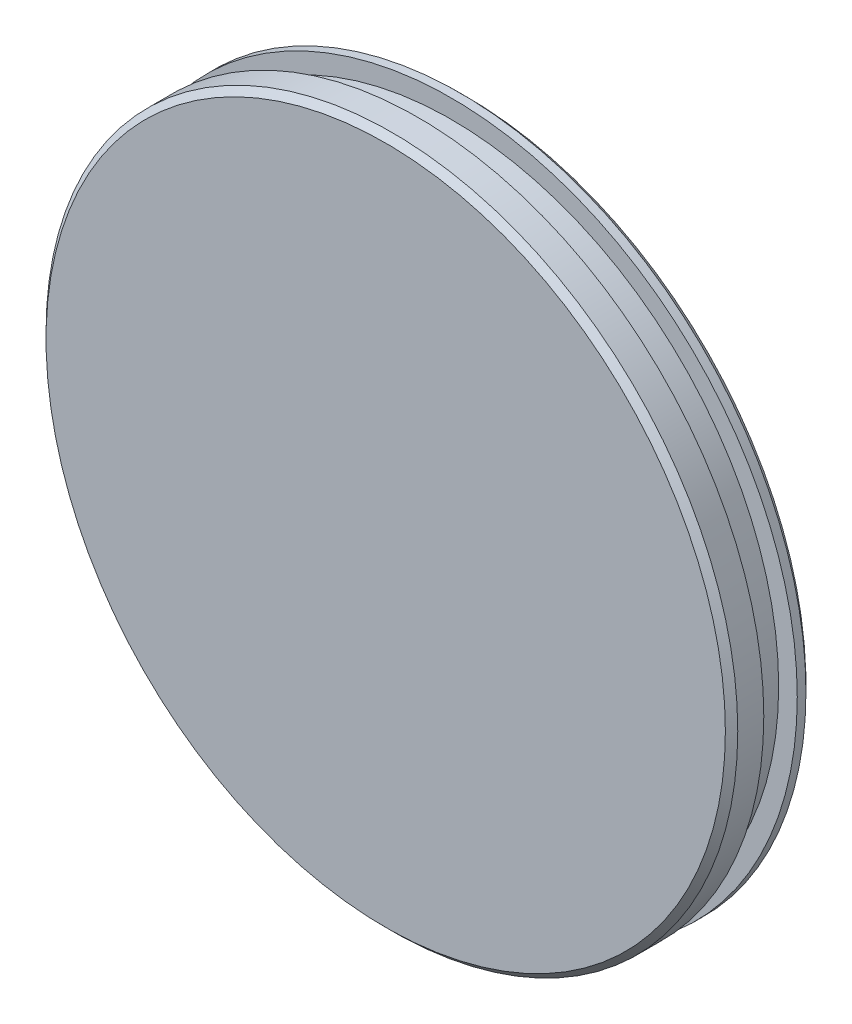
ISO-10303-21;
HEADER;
FILE_DESCRIPTION(('STEP AP214'),'2;1');
FILE_NAME('part.step','',(''),(''),'','','');
FILE_SCHEMA(('AUTOMOTIVE_DESIGN { 1 0 10303 214 1 1 1 1 }'));
ENDSEC;
DATA;
#1=APPLICATION_CONTEXT('core data for automotive mechanical design processes');
#2=APPLICATION_PROTOCOL_DEFINITION('international standard','automotive_design',2000,#1);
#3=PRODUCT_CONTEXT('',#1,'mechanical');
#4=PRODUCT('Part','Part','',(#3));
#5=PRODUCT_RELATED_PRODUCT_CATEGORY('part','',(#4));
#6=PRODUCT_DEFINITION_FORMATION('','',#4);
#7=PRODUCT_DEFINITION_CONTEXT('part definition',#1,'design');
#8=PRODUCT_DEFINITION('design','',#6,#7);
#9=PRODUCT_DEFINITION_SHAPE('','',#8);
#10=(LENGTH_UNIT() NAMED_UNIT(*) SI_UNIT(.MILLI.,.METRE.));
#11=(NAMED_UNIT(*) PLANE_ANGLE_UNIT() SI_UNIT($,.RADIAN.));
#12=(NAMED_UNIT(*) SI_UNIT($,.STERADIAN.) SOLID_ANGLE_UNIT());
#13=UNCERTAINTY_MEASURE_WITH_UNIT(LENGTH_MEASURE(1.E-05),#10,'distance_accuracy_value','');
#14=(GEOMETRIC_REPRESENTATION_CONTEXT(3) GLOBAL_UNCERTAINTY_ASSIGNED_CONTEXT((#13)) GLOBAL_UNIT_ASSIGNED_CONTEXT((#10,
#11,#12)) REPRESENTATION_CONTEXT('',''));
#15=CARTESIAN_POINT('',(0.,0.,0.));
#16=DIRECTION('',(0.,0.,1.));
#17=DIRECTION('',(1.,0.,0.));
#18=AXIS2_PLACEMENT_3D('',#15,#16,#17);
#19=CARTESIAN_POINT('',(27.9,0.,0.));
#20=DIRECTION('',(0.,0.,1.));
#21=DIRECTION('',(1.,0.,0.));
#22=AXIS2_PLACEMENT_3D('',#19,#20,#21);
#23=PLANE('',#22);
#24=CARTESIAN_POINT('',(27.9,0.,0.));
#25=DIRECTION('',(0.,0.,1.));
#26=DIRECTION('',(1.,0.,0.));
#27=AXIS2_PLACEMENT_3D('',#24,#25,#26);
#28=CIRCLE('',#27,27.4);
#29=CARTESIAN_POINT('',(55.3,0.,0.));
#30=VERTEX_POINT('',#29);
#31=EDGE_CURVE('E37',#30,#30,#28,.T.);
#32=ORIENTED_EDGE('',*,*,#31,.T.);
#33=EDGE_LOOP('',(#32));
#34=FACE_BOUND('',#33,.T.);
#35=ADVANCED_FACE('F14',(#34),#23,.T.);
#36=CARTESIAN_POINT('',(27.9,0.,0.));
#37=DIRECTION('',(0.,0.,1.));
#38=DIRECTION('',(1.,0.,0.));
#39=AXIS2_PLACEMENT_3D('',#36,#37,#38);
#40=CYLINDRICAL_SURFACE('',#39,27.9);
#41=CARTESIAN_POINT('',(27.9,0.,-0.499999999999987));
#42=DIRECTION('',(0.,0.,1.));
#43=DIRECTION('',(1.,0.,0.));
#44=AXIS2_PLACEMENT_3D('',#41,#42,#43);
#45=CIRCLE('',#44,27.9);
#46=CARTESIAN_POINT('',(55.8,0.,-0.499999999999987));
#47=VERTEX_POINT('',#46);
#48=EDGE_CURVE('E34',#47,#47,#45,.F.);
#49=ORIENTED_EDGE('',*,*,#48,.T.);
#50=EDGE_LOOP('',(#49));
#51=FACE_BOUND('',#50,.T.);
#52=CARTESIAN_POINT('',(27.9,0.,-2.6));
#53=DIRECTION('',(0.,0.,1.));
#54=DIRECTION('',(1.,0.,0.));
#55=AXIS2_PLACEMENT_3D('',#52,#53,#54);
#56=CIRCLE('',#55,27.9);
#57=CARTESIAN_POINT('',(55.8,0.,-2.6));
#58=VERTEX_POINT('',#57);
#59=EDGE_CURVE('E46',#58,#58,#56,.T.);
#60=ORIENTED_EDGE('',*,*,#59,.T.);
#61=EDGE_LOOP('',(#60));
#62=FACE_BOUND('',#61,.T.);
#63=ADVANCED_FACE('F84',(#51,#62),#40,.T.);
#64=CARTESIAN_POINT('',(0.,0.,-2.6));
#65=DIRECTION('',(0.,0.,-1.));
#66=DIRECTION('',(-1.,0.,0.));
#67=AXIS2_PLACEMENT_3D('',#64,#65,#66);
#68=PLANE('',#67);
#69=CARTESIAN_POINT('',(27.9,0.,-2.6));
#70=DIRECTION('',(0.,0.,1.));
#71=DIRECTION('',(1.,0.,0.));
#72=AXIS2_PLACEMENT_3D('',#69,#70,#71);
#73=CIRCLE('',#72,26.4);
#74=CARTESIAN_POINT('',(54.3,0.,-2.6));
#75=VERTEX_POINT('',#74);
#76=EDGE_CURVE('E49',#75,#75,#73,.T.);
#77=ORIENTED_EDGE('',*,*,#76,.T.);
#78=EDGE_LOOP('',(#77));
#79=FACE_BOUND('',#78,.T.);
#80=ORIENTED_EDGE('',*,*,#59,.F.);
#81=EDGE_LOOP('',(#80));
#82=FACE_BOUND('',#81,.T.);
#83=ADVANCED_FACE('F91',(#79,#82),#68,.T.);
#84=CARTESIAN_POINT('',(27.9,0.,0.));
#85=DIRECTION('',(0.,0.,1.));
#86=DIRECTION('',(1.,0.,0.));
#87=AXIS2_PLACEMENT_3D('',#84,#85,#86);
#88=CYLINDRICAL_SURFACE('',#87,26.4);
#89=CARTESIAN_POINT('',(27.9,0.,-5.3));
#90=DIRECTION('',(0.,0.,1.));
#91=DIRECTION('',(1.,0.,0.));
#92=AXIS2_PLACEMENT_3D('',#89,#90,#91);
#93=CIRCLE('',#92,26.4);
#94=CARTESIAN_POINT('',(54.3,0.,-5.3));
#95=VERTEX_POINT('',#94);
#96=EDGE_CURVE('E52',#95,#95,#93,.T.);
#97=ORIENTED_EDGE('',*,*,#96,.T.);
#98=EDGE_LOOP('',(#97));
#99=FACE_BOUND('',#98,.T.);
#100=ORIENTED_EDGE('',*,*,#76,.F.);
#101=EDGE_LOOP('',(#100));
#102=FACE_BOUND('',#101,.T.);
#103=ADVANCED_FACE('F120',(#99,#102),#88,.T.);
#104=CARTESIAN_POINT('',(1.5,0.,-5.3));
#105=DIRECTION('',(0.,0.,1.));
#106=DIRECTION('',(1.,0.,0.));
#107=AXIS2_PLACEMENT_3D('',#104,#105,#106);
#108=PLANE('',#107);
#109=CARTESIAN_POINT('',(27.9,0.,-5.3));
#110=DIRECTION('',(0.,0.,1.));
#111=DIRECTION('',(1.,0.,0.));
#112=AXIS2_PLACEMENT_3D('',#109,#110,#111);
#113=CIRCLE('',#112,27.9);
#114=CARTESIAN_POINT('',(55.8,0.,-5.3));
#115=VERTEX_POINT('',#114);
#116=EDGE_CURVE('E55',#115,#115,#113,.T.);
#117=ORIENTED_EDGE('',*,*,#116,.T.);
#118=EDGE_LOOP('',(#117));
#119=FACE_BOUND('',#118,.T.);
#120=ORIENTED_EDGE('',*,*,#96,.F.);
#121=EDGE_LOOP('',(#120));
#122=FACE_BOUND('',#121,.T.);
#123=ADVANCED_FACE('F114',(#119,#122),#108,.T.);
#124=CARTESIAN_POINT('',(27.9,0.,0.));
#125=DIRECTION('',(0.,0.,1.));
#126=DIRECTION('',(1.,0.,0.));
#127=AXIS2_PLACEMENT_3D('',#124,#125,#126);
#128=CYLINDRICAL_SURFACE('',#127,27.9);
#129=CARTESIAN_POINT('',(27.9,0.,-6.));
#130=DIRECTION('',(0.,0.,-1.));
#131=DIRECTION('',(-1.,0.,0.));
#132=AXIS2_PLACEMENT_3D('',#129,#130,#131);
#133=CIRCLE('',#132,27.9);
#134=CARTESIAN_POINT('',(0.,0.,-6.));
#135=VERTEX_POINT('',#134);
#136=EDGE_CURVE('E29',#135,#135,#133,.F.);
#137=ORIENTED_EDGE('',*,*,#136,.T.);
#138=EDGE_LOOP('',(#137));
#139=FACE_BOUND('',#138,.T.);
#140=ORIENTED_EDGE('',*,*,#116,.F.);
#141=EDGE_LOOP('',(#140));
#142=FACE_BOUND('',#141,.T.);
#143=ADVANCED_FACE('F110',(#139,#142),#128,.T.);
#144=CARTESIAN_POINT('',(0.,0.,-6.5));
#145=DIRECTION('',(0.,0.,-1.));
#146=DIRECTION('',(-1.,0.,0.));
#147=AXIS2_PLACEMENT_3D('',#144,#145,#146);
#148=PLANE('',#147);
#149=CARTESIAN_POINT('',(27.9,0.,-6.5));
#150=DIRECTION('',(0.,0.,-1.));
#151=DIRECTION('',(-1.,0.,0.));
#152=AXIS2_PLACEMENT_3D('',#149,#150,#151);
#153=CIRCLE('',#152,4.);
#154=CARTESIAN_POINT('',(23.9,0.,-6.5));
#155=VERTEX_POINT('',#154);
#156=EDGE_CURVE('E21',#155,#155,#153,.F.);
#157=ORIENTED_EDGE('',*,*,#156,.T.);
#158=EDGE_LOOP('',(#157));
#159=FACE_BOUND('',#158,.T.);
#160=CARTESIAN_POINT('',(27.9,0.,-6.5));
#161=DIRECTION('',(0.,0.,-1.));
#162=DIRECTION('',(-1.,0.,0.));
#163=AXIS2_PLACEMENT_3D('',#160,#161,#162);
#164=CIRCLE('',#163,27.4);
#165=CARTESIAN_POINT('',(0.5,0.,-6.5));
#166=VERTEX_POINT('',#165);
#167=EDGE_CURVE('E25',#166,#166,#164,.T.);
#168=ORIENTED_EDGE('',*,*,#167,.T.);
#169=EDGE_LOOP('',(#168));
#170=FACE_BOUND('',#169,.T.);
#171=ADVANCED_FACE('F113',(#159,#170),#148,.T.);
#172=CARTESIAN_POINT('',(27.9,0.,0.));
#173=DIRECTION('',(0.,0.,1.));
#174=DIRECTION('',(1.,0.,0.));
#175=AXIS2_PLACEMENT_3D('',#172,#173,#174);
#176=CYLINDRICAL_SURFACE('',#175,3.);
#177=CARTESIAN_POINT('',(27.9,0.,-7.5));
#178=DIRECTION('',(0.,0.,-1.));
#179=DIRECTION('',(-1.,0.,0.));
#180=AXIS2_PLACEMENT_3D('',#177,#178,#179);
#181=CIRCLE('',#180,3.);
#182=CARTESIAN_POINT('',(24.9,0.,-7.5));
#183=VERTEX_POINT('',#182);
#184=EDGE_CURVE('E10',#183,#183,#181,.T.);
#185=ORIENTED_EDGE('',*,*,#184,.T.);
#186=EDGE_LOOP('',(#185));
#187=FACE_BOUND('',#186,.T.);
#188=CARTESIAN_POINT('',(27.9,0.,-9.5));
#189=DIRECTION('',(0.,0.,1.));
#190=DIRECTION('',(1.,0.,0.));
#191=AXIS2_PLACEMENT_3D('',#188,#189,#190);
#192=CIRCLE('',#191,3.);
#193=CARTESIAN_POINT('',(30.9,0.,-9.5));
#194=VERTEX_POINT('',#193);
#195=EDGE_CURVE('E58',#194,#194,#192,.T.);
#196=ORIENTED_EDGE('',*,*,#195,.T.);
#197=EDGE_LOOP('',(#196));
#198=FACE_BOUND('',#197,.T.);
#199=ADVANCED_FACE('F139',(#187,#198),#176,.T.);
#200=CARTESIAN_POINT('',(26.6,0.,-9.5));
#201=DIRECTION('',(0.,0.,-1.));
#202=DIRECTION('',(-1.,0.,0.));
#203=AXIS2_PLACEMENT_3D('',#200,#201,#202);
#204=PLANE('',#203);
#205=CARTESIAN_POINT('',(27.9,0.,-9.5));
#206=DIRECTION('',(0.,0.,-1.));
#207=DIRECTION('',(-1.,0.,0.));
#208=AXIS2_PLACEMENT_3D('',#205,#206,#207);
#209=CIRCLE('',#208,1.8);
#210=CARTESIAN_POINT('',(26.1,0.,-9.5));
#211=VERTEX_POINT('',#210);
#212=EDGE_CURVE('E43',#211,#211,#209,.F.);
#213=ORIENTED_EDGE('',*,*,#212,.T.);
#214=EDGE_LOOP('',(#213));
#215=FACE_BOUND('',#214,.T.);
#216=ORIENTED_EDGE('',*,*,#195,.F.);
#217=EDGE_LOOP('',(#216));
#218=FACE_BOUND('',#217,.T.);
#219=ADVANCED_FACE('F80',(#215,#218),#204,.T.);
#220=CARTESIAN_POINT('',(27.9,0.,0.));
#221=DIRECTION('',(0.,0.,1.));
#222=DIRECTION('',(1.,0.,0.));
#223=AXIS2_PLACEMENT_3D('',#220,#221,#222);
#224=CYLINDRICAL_SURFACE('',#223,1.3);
#225=CARTESIAN_POINT('',(27.9,0.,-9.));
#226=DIRECTION('',(0.,0.,-1.));
#227=DIRECTION('',(-1.,0.,0.));
#228=AXIS2_PLACEMENT_3D('',#225,#226,#227);
#229=CIRCLE('',#228,1.3);
#230=CARTESIAN_POINT('',(26.6,0.,-9.));
#231=VERTEX_POINT('',#230);
#232=EDGE_CURVE('E40',#231,#231,#229,.T.);
#233=ORIENTED_EDGE('',*,*,#232,.T.);
#234=EDGE_LOOP('',(#233));
#235=FACE_BOUND('',#234,.T.);
#236=CARTESIAN_POINT('',(27.9,0.,-5.5));
#237=DIRECTION('',(0.,0.,1.));
#238=DIRECTION('',(1.,0.,0.));
#239=AXIS2_PLACEMENT_3D('',#236,#237,#238);
#240=CIRCLE('',#239,1.3);
#241=CARTESIAN_POINT('',(29.2,0.,-5.5));
#242=VERTEX_POINT('',#241);
#243=EDGE_CURVE('E61',#242,#242,#240,.T.);
#244=ORIENTED_EDGE('',*,*,#243,.T.);
#245=EDGE_LOOP('',(#244));
#246=FACE_BOUND('',#245,.T.);
#247=ADVANCED_FACE('F65',(#235,#246),#224,.F.);
#248=CARTESIAN_POINT('',(27.9,0.,-5.5));
#249=DIRECTION('',(0.,0.,-1.));
#250=DIRECTION('',(-1.,0.,0.));
#251=AXIS2_PLACEMENT_3D('',#248,#249,#250);
#252=PLANE('',#251);
#253=ORIENTED_EDGE('',*,*,#243,.F.);
#254=EDGE_LOOP('',(#253));
#255=FACE_BOUND('',#254,.T.);
#256=ADVANCED_FACE('F67',(#255),#252,.T.);
#257=CARTESIAN_POINT('',(27.9,0.,-9.5));
#258=DIRECTION('',(0.,0.,-1.));
#259=DIRECTION('',(-1.,0.,0.));
#260=AXIS2_PLACEMENT_3D('',#257,#258,#259);
#261=CONICAL_SURFACE('',#260,1.8,0.785398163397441);
#262=ORIENTED_EDGE('',*,*,#232,.F.);
#263=EDGE_LOOP('',(#262));
#264=FACE_BOUND('',#263,.T.);
#265=ORIENTED_EDGE('',*,*,#212,.F.);
#266=EDGE_LOOP('',(#265));
#267=FACE_BOUND('',#266,.T.);
#268=ADVANCED_FACE('F69',(#264,#267),#261,.F.);
#269=CARTESIAN_POINT('',(27.9,0.,0.));
#270=DIRECTION('',(0.,0.,-1.));
#271=DIRECTION('',(-1.,0.,0.));
#272=AXIS2_PLACEMENT_3D('',#269,#270,#271);
#273=CONICAL_SURFACE('',#272,27.4,0.785398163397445);
#274=ORIENTED_EDGE('',*,*,#48,.F.);
#275=EDGE_LOOP('',(#274));
#276=FACE_BOUND('',#275,.T.);
#277=ORIENTED_EDGE('',*,*,#31,.F.);
#278=EDGE_LOOP('',(#277));
#279=FACE_BOUND('',#278,.T.);
#280=ADVANCED_FACE('F77',(#276,#279),#273,.T.);
#281=CARTESIAN_POINT('',(27.9,0.,-6.));
#282=DIRECTION('',(0.,0.,1.));
#283=DIRECTION('',(1.,0.,0.));
#284=AXIS2_PLACEMENT_3D('',#281,#282,#283);
#285=CONICAL_SURFACE('',#284,27.9,0.785398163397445);
#286=ORIENTED_EDGE('',*,*,#167,.F.);
#287=EDGE_LOOP('',(#286));
#288=FACE_BOUND('',#287,.T.);
#289=ORIENTED_EDGE('',*,*,#136,.F.);
#290=EDGE_LOOP('',(#289));
#291=FACE_BOUND('',#290,.T.);
#292=ADVANCED_FACE('F97',(#288,#291),#285,.T.);
#293=CARTESIAN_POINT('',(27.9,0.,-7.5));
#294=DIRECTION('',(0.,0.,-1.));
#295=DIRECTION('',(-1.,0.,0.));
#296=AXIS2_PLACEMENT_3D('',#293,#294,#295);
#297=TOROIDAL_SURFACE('',#296,4.,1.);
#298=ORIENTED_EDGE('',*,*,#184,.F.);
#299=EDGE_LOOP('',(#298));
#300=FACE_BOUND('',#299,.T.);
#301=ORIENTED_EDGE('',*,*,#156,.F.);
#302=EDGE_LOOP('',(#301));
#303=FACE_BOUND('',#302,.T.);
#304=ADVANCED_FACE('F16',(#300,#303),#297,.F.);
#305=CLOSED_SHELL('',(#35,#63,#83,#103,#123,#143,#171,#199,#219,#247,#256,#268,#280,#292,#304));
#306=MANIFOLD_SOLID_BREP('B1',#305);
#307=ADVANCED_BREP_SHAPE_REPRESENTATION('',(#18,#306),#14);
#308=SHAPE_DEFINITION_REPRESENTATION(#9,#307);
ENDSEC;
END-ISO-10303-21;
